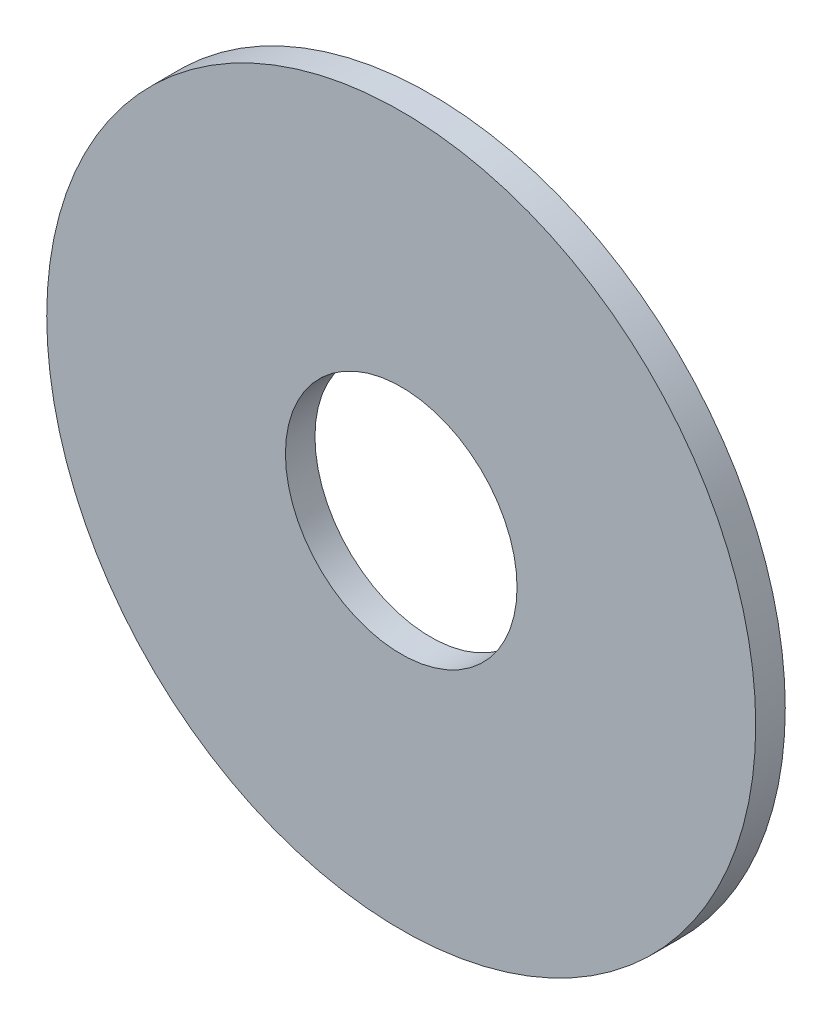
ISO-10303-21;
HEADER;
FILE_DESCRIPTION(('STEP AP214'),'2;1');
FILE_NAME('part.step','',(''),(''),'','','');
FILE_SCHEMA(('AUTOMOTIVE_DESIGN { 1 0 10303 214 1 1 1 1 }'));
ENDSEC;
DATA;
#1=APPLICATION_CONTEXT('core data for automotive mechanical design processes');
#2=APPLICATION_PROTOCOL_DEFINITION('international standard','automotive_design',2000,#1);
#3=PRODUCT_CONTEXT('',#1,'mechanical');
#4=PRODUCT('Part','Part','',(#3));
#5=PRODUCT_RELATED_PRODUCT_CATEGORY('part','',(#4));
#6=PRODUCT_DEFINITION_FORMATION('','',#4);
#7=PRODUCT_DEFINITION_CONTEXT('part definition',#1,'design');
#8=PRODUCT_DEFINITION('design','',#6,#7);
#9=PRODUCT_DEFINITION_SHAPE('','',#8);
#10=(LENGTH_UNIT() NAMED_UNIT(*) SI_UNIT(.MILLI.,.METRE.));
#11=(NAMED_UNIT(*) PLANE_ANGLE_UNIT() SI_UNIT($,.RADIAN.));
#12=(NAMED_UNIT(*) SI_UNIT($,.STERADIAN.) SOLID_ANGLE_UNIT());
#13=UNCERTAINTY_MEASURE_WITH_UNIT(LENGTH_MEASURE(1.E-05),#10,'distance_accuracy_value','');
#14=(GEOMETRIC_REPRESENTATION_CONTEXT(3) GLOBAL_UNCERTAINTY_ASSIGNED_CONTEXT((#13)) GLOBAL_UNIT_ASSIGNED_CONTEXT((#10,
#11,#12)) REPRESENTATION_CONTEXT('',''));
#15=CARTESIAN_POINT('',(0.,0.,0.));
#16=DIRECTION('',(0.,0.,1.));
#17=DIRECTION('',(1.,0.,0.));
#18=AXIS2_PLACEMENT_3D('',#15,#16,#17);
#19=CARTESIAN_POINT('',(0.,0.,0.5));
#20=DIRECTION('',(0.,0.,1.));
#21=DIRECTION('',(1.,0.,0.));
#22=AXIS2_PLACEMENT_3D('',#19,#20,#21);
#23=PLANE('',#22);
#24=CARTESIAN_POINT('',(0.,0.,0.5));
#25=DIRECTION('',(0.,0.,1.));
#26=DIRECTION('',(1.,0.,0.));
#27=AXIS2_PLACEMENT_3D('',#24,#25,#26);
#28=CIRCLE('',#27,6.);
#29=CARTESIAN_POINT('',(6.,0.,0.5));
#30=VERTEX_POINT('',#29);
#31=EDGE_CURVE('E10',#30,#30,#28,.T.);
#32=ORIENTED_EDGE('',*,*,#31,.T.);
#33=EDGE_LOOP('',(#32));
#34=FACE_BOUND('',#33,.T.);
#35=CARTESIAN_POINT('',(0.,0.,0.5));
#36=DIRECTION('',(0.,0.,1.));
#37=DIRECTION('',(1.,0.,0.));
#38=AXIS2_PLACEMENT_3D('',#35,#36,#37);
#39=CIRCLE('',#38,1.96);
#40=CARTESIAN_POINT('',(1.96,0.,0.5));
#41=VERTEX_POINT('',#40);
#42=EDGE_CURVE('E46',#41,#41,#39,.T.);
#43=ORIENTED_EDGE('',*,*,#42,.F.);
#44=EDGE_LOOP('',(#43));
#45=FACE_BOUND('',#44,.T.);
#46=ADVANCED_FACE('F35',(#34,#45),#23,.T.);
#47=CARTESIAN_POINT('',(0.,0.,0.));
#48=DIRECTION('',(0.,0.,1.));
#49=DIRECTION('',(1.,0.,0.));
#50=AXIS2_PLACEMENT_3D('',#47,#48,#49);
#51=PLANE('',#50);
#52=CARTESIAN_POINT('',(0.,0.,0.));
#53=DIRECTION('',(0.,0.,1.));
#54=DIRECTION('',(1.,0.,0.));
#55=AXIS2_PLACEMENT_3D('',#52,#53,#54);
#56=CIRCLE('',#55,6.);
#57=CARTESIAN_POINT('',(6.,0.,0.));
#58=VERTEX_POINT('',#57);
#59=EDGE_CURVE('E42',#58,#58,#56,.T.);
#60=ORIENTED_EDGE('',*,*,#59,.F.);
#61=EDGE_LOOP('',(#60));
#62=FACE_BOUND('',#61,.T.);
#63=CARTESIAN_POINT('',(0.,0.,0.));
#64=DIRECTION('',(0.,0.,1.));
#65=DIRECTION('',(1.,0.,0.));
#66=AXIS2_PLACEMENT_3D('',#63,#64,#65);
#67=CIRCLE('',#66,1.96);
#68=CARTESIAN_POINT('',(1.96,0.,0.));
#69=VERTEX_POINT('',#68);
#70=EDGE_CURVE('E50',#69,#69,#67,.T.);
#71=ORIENTED_EDGE('',*,*,#70,.T.);
#72=EDGE_LOOP('',(#71));
#73=FACE_BOUND('',#72,.T.);
#74=ADVANCED_FACE('F56',(#62,#73),#51,.F.);
#75=CARTESIAN_POINT('',(0.,0.,0.5));
#76=DIRECTION('',(0.,0.,-1.));
#77=DIRECTION('',(-1.,0.,0.));
#78=AXIS2_PLACEMENT_3D('',#75,#76,#77);
#79=CYLINDRICAL_SURFACE('',#78,6.);
#80=ORIENTED_EDGE('',*,*,#31,.F.);
#81=EDGE_LOOP('',(#80));
#82=FACE_BOUND('',#81,.T.);
#83=ORIENTED_EDGE('',*,*,#59,.T.);
#84=EDGE_LOOP('',(#83));
#85=FACE_BOUND('',#84,.T.);
#86=ADVANCED_FACE('F37',(#82,#85),#79,.T.);
#87=CARTESIAN_POINT('',(0.,0.,0.5));
#88=DIRECTION('',(0.,0.,-1.));
#89=DIRECTION('',(-1.,0.,0.));
#90=AXIS2_PLACEMENT_3D('',#87,#88,#89);
#91=CYLINDRICAL_SURFACE('',#90,1.96);
#92=ORIENTED_EDGE('',*,*,#42,.T.);
#93=EDGE_LOOP('',(#92));
#94=FACE_BOUND('',#93,.T.);
#95=ORIENTED_EDGE('',*,*,#70,.F.);
#96=EDGE_LOOP('',(#95));
#97=FACE_BOUND('',#96,.T.);
#98=ADVANCED_FACE('F58',(#94,#97),#91,.F.);
#99=CLOSED_SHELL('',(#46,#74,#86,#98));
#100=MANIFOLD_SOLID_BREP('B2',#99);
#101=ADVANCED_BREP_SHAPE_REPRESENTATION('',(#18,#100),#14);
#102=SHAPE_DEFINITION_REPRESENTATION(#9,#101);
ENDSEC;
END-ISO-10303-21;
